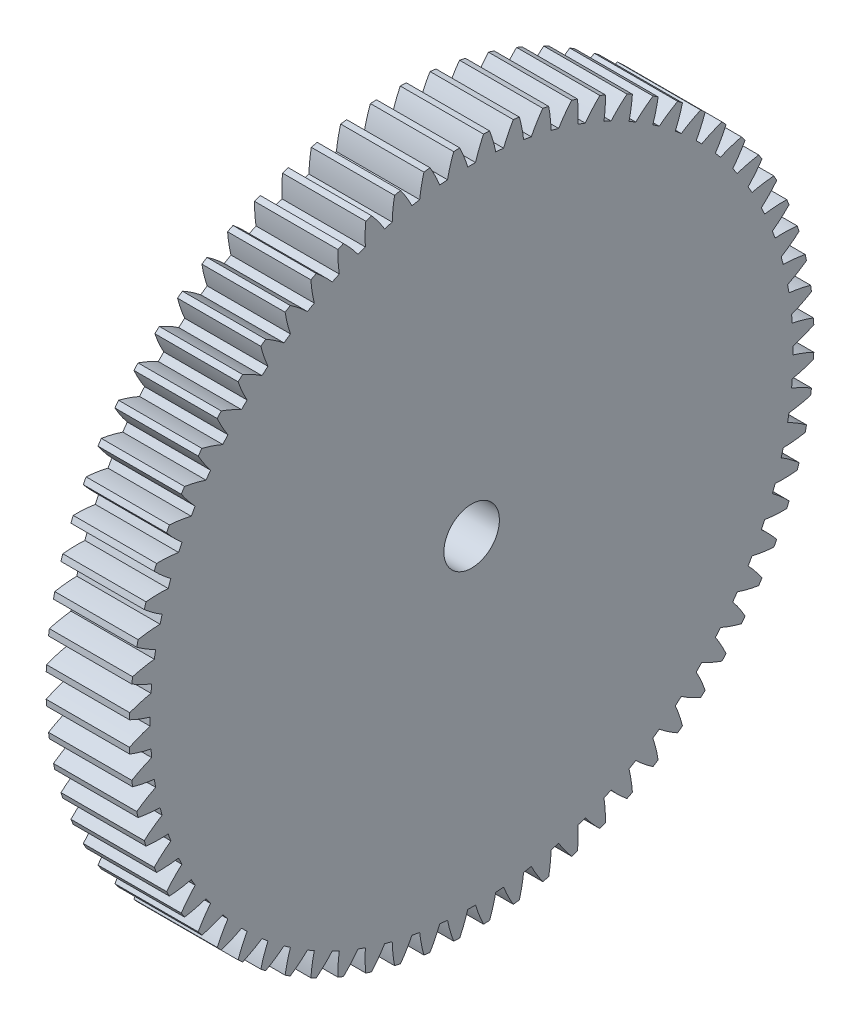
from build123d import *

# Parameters (mm, degrees)
BASPROSKE_W             = 9
BASPROSKE_H             = 37
TOOTHCUT_DEPTH          = 54.09425581
TEETHCUTS_COUNT         = 72
TEETHCUTS_ANGLE         = 355
HUBNEAONESKE_R          = 10.5
HUBNEARONE_DEPTH        = 9.0000508
BORSKE_R                = 3
BORE_DEPTH              = 18.0000508
CUT_EXTRUDE1_START      = -2.2
SKETCH1_R               = 33
SKETCH1_R_2             = 10.5
CUT_EXTRUDE1_DEPTH      = 2.2
CUT_EXTRUDE3_DEPTH      = 54.063076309
CUT_EXTRUDE3_DEPTH_BACK = 54.063076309
SKETCH2_W               = 4.5000508
SKETCH2_H               = 21
CUT_EXTRUDE5_REACH      = 55.063
CUT_EXTRUDE5_END_RADIUS = 10.5
SKETCH4_R               = 1.35


with BuildPart() as part:
    # BasProSke → Base-Revolve (revolve)
    with BuildSketch(Plane(origin=(0, 0, 0), x_dir=(1, 0, 0), z_dir=(0, 1, 0)), mode=Mode.PRIVATE) as base_revolve_sk:
        with Locations((4.5, 18.5)):
            Rectangle(BASPROSKE_W, BASPROSKE_H)
    revolve(base_revolve_sk.sketch.rotate(Axis((-10, 0, 0), (1, 0, 0)), 180), axis=Axis((-10, 0, 0), (1, 0, 0)))

    # TooCutSke → ToothCut (cut, through all)
    with BuildSketch(Plane(origin=(0, 0, 0), x_dir=(0, 0, -1), z_dir=(1, 0, 0))):
        with BuildLine():
            ThreePointArc((0.423780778, 34.746415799), (0, 34.749), (-0.423780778, 34.746415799))
            ThreePointArc((-0.423780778, 34.746415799), (-0.813812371, 35.892927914), (-1.298800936, 37.002612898))
            ThreePointArc((-1.298800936, 37.002612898), (0, 37.0254), (1.298800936, 37.002612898))
            ThreePointArc((1.298800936, 37.002612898), (0.813812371, 35.892927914), (0.423780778, 34.746415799))
        make_face()
    toothcut = extrude(amount=TOOTHCUT_DEPTH, mode=Mode.SUBTRACT)

    # TeethCuts: ToothCut ×72 about axis
    teethcuts_axis = Axis((-10, 0, 0), (1, 0, 0))
    for i in range(1, TEETHCUTS_COUNT):
        add(toothcut.rotate(teethcuts_axis, i * TEETHCUTS_ANGLE / (TEETHCUTS_COUNT - 1)), mode=Mode.SUBTRACT)

    # HubNeaOneSke → HubNearOne (add)
    with BuildSketch(Plane.ZY):
        with Locations(Location((0, 0, 0), (0, 0, 180))):
            Circle(HUBNEAONESKE_R)
    extrude(amount=HUBNEARONE_DEPTH)

    # BorSke → Bore (cut, symmetric)
    with BuildSketch(Plane(origin=(0, 0, 0), x_dir=(0, 0, -1), z_dir=(1, 0, 0))):
        with Locations(Location((0, 0, 0), (0, 0, 180))):
            Circle(BORSKE_R)
    extrude(amount=BORE_DEPTH, both=True, mode=Mode.SUBTRACT)

    # Sketch1 → Cut-Extrude1 (cut)
    with BuildSketch(Plane.ZY.offset(CUT_EXTRUDE1_START)):
        Circle(SKETCH1_R)
        with Locations(Location((0, 0, 0), (0, 0, 180))):
            Circle(SKETCH1_R_2, mode=Mode.SUBTRACT)
    extrude(amount=CUT_EXTRUDE1_DEPTH, mode=Mode.SUBTRACT)

    # Sketch2 → Cut-Extrude3 (cut, two sides: drawn at the far end of the back side and taken through both)
    with BuildSketch(Plane(origin=(0, 0, 0), x_dir=(1, 0, 0), z_dir=(0, 1, 0)).offset(-CUT_EXTRUDE3_DEPTH_BACK)):
        with Locations((-6.7500254, 0)):
            Rectangle(SKETCH2_W, SKETCH2_H)
    extrude(amount=CUT_EXTRUDE3_DEPTH + CUT_EXTRUDE3_DEPTH_BACK, mode=Mode.SUBTRACT)

    # Cut-Extrude5: up to this cylinder (the profile starts inside it)
    cut_extrude5_end = Plane(origin=(-1.4, 0, 0), z_dir=(1, 0, 0)) * Cylinder(CUT_EXTRUDE5_END_RADIUS, 132.126, mode=Mode.PRIVATE)
    # Sketch4 → Cut-Extrude5 (cut, up to the surface)
    with BuildSketch(Plane(origin=(0, 0, 0), x_dir=(1, 0, 0), z_dir=(0, 1, 0)), mode=Mode.PRIVATE) as cut_extrude5_sk1:
        with Locations(Location((-1.4, 0, 0), (0, 0, 270))):
            Circle(SKETCH4_R)
    cut_extrude5_tool1 = extrude(cut_extrude5_sk1.sketch, amount=-CUT_EXTRUDE5_REACH, mode=Mode.PRIVATE) & cut_extrude5_end
    add(cut_extrude5_tool1.solids().sort_by_distance((-1.4, 0, 0))[0], mode=Mode.SUBTRACT)


solid = part.part
